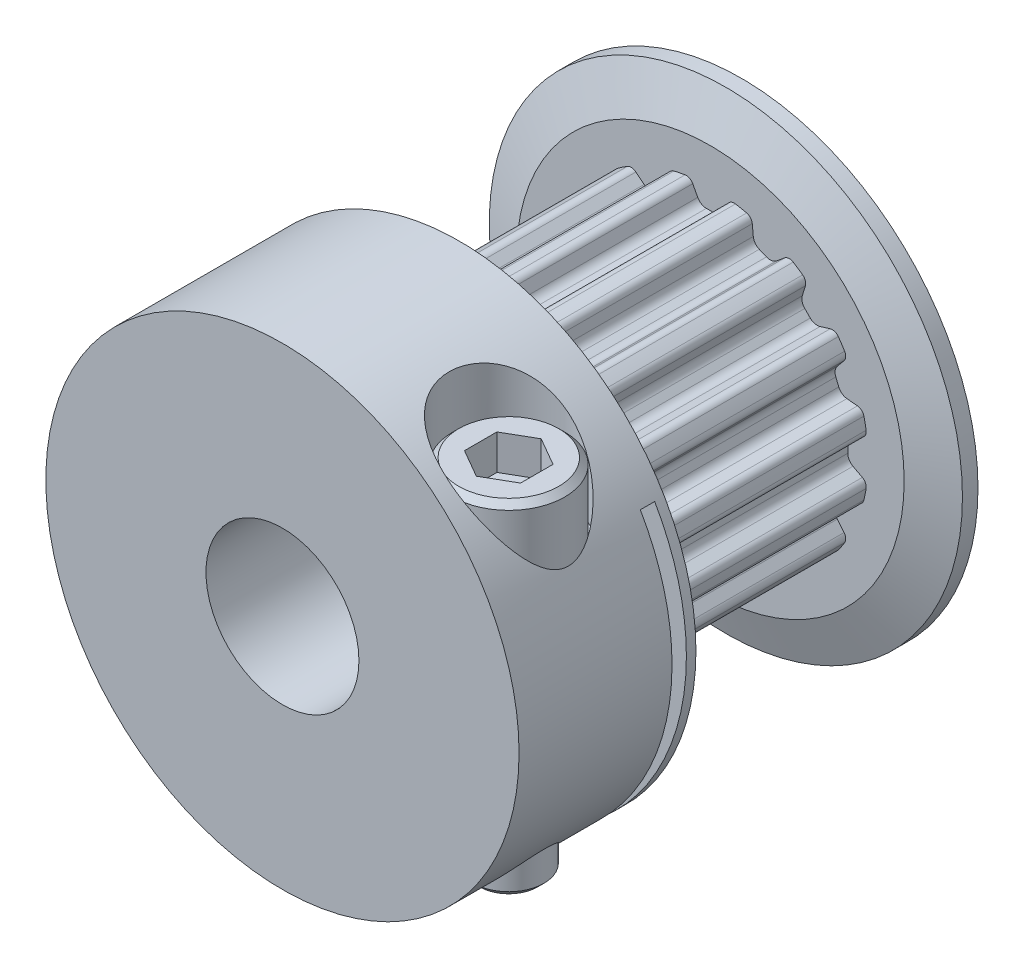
from build123d import *

# Parameters (mm, degrees)
SKETCH1_W               = 5.953125
SKETCH1_H               = 4.98475
SKETCH2_W               = 0.446484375
SKETCH2_H               = 4.98475
CUT_REVOLVE1_ANGLE      = 180
CUT_EXTRUDE1_DEPTH      = 1.0922
EXTRUDE1_START          = 7.366
SKETCH7_R               = 4.9149
SKETCH7_R_2             = 2.38125
EXTRUDE1_DEPTH          = 7.366
CUT_EXTRUDE2_START      = -8.6979125
CUT_EXTRUDE2_DEPTH      = 8.6979125
CIRPATTERN1_COUNT       = 16
EXTRUDE2_START          = 0.4841875
SKETCH11_R              = 4.9149
SKETCH11_R_2            = 2.38125
EXTRUDE2_DEPTH          = 0.4841875
SKETCH12_R              = 3.673475
SKETCH12_R_2            = 3.622675
CUT_EXTRUDE_THIN1_DEPTH = 0.0508


with BuildPart() as part:
    # Sketch1 → Revolve1 (revolve)
    with BuildSketch(Plane(origin=(0, 0, 0), x_dir=(0, 0, -1), z_dir=(1, 0, 0)), mode=Mode.PRIVATE) as revolve1_sk:
        with Locations((-2.9765625, 4.873625)):
            Rectangle(SKETCH1_W, SKETCH1_H)
    revolve(revolve1_sk.sketch.rotate(Axis((0, 0, 6.25078125), (0, 0, -1)), 90), axis=Axis((0, 0, 6.25078125), (0, 0, -1)))

    # Sketch2 → Cut-Revolve1 (revolve, cut)
    with BuildSketch(Plane(origin=(0, 0, 0), x_dir=(0, 0, -1), z_dir=(-0.49999999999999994, 0.8660254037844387, 0))):
        with Locations((-0.967382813, 4.873625)):
            Rectangle(SKETCH2_W, SKETCH2_H)
    revolve(axis=Axis((0, 0, 1.212949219), (0, 0, 1)), revolution_arc=CUT_REVOLVE1_ANGLE, mode=Mode.SUBTRACT)

    # Sketch4 → Cut-Revolve2 (revolve, cut)
    with BuildSketch(Plane.XY.offset(3.571875), mode=Mode.PRIVATE) as cut_revolve2_sk:
        Polygon((2.807335, 6.810053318), (2.807335, 3.24104), (3.560953, 3.24104), (3.560953, -6.448067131), (4.664075, -6.448067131), (4.664075, 6.810053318), align=None)
    revolve(cut_revolve2_sk.sketch.rotate(Axis((4.664075, -7.110973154, 3.571875), (0, 1, 0)), 90), axis=Axis((4.664075, -7.110973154, 3.571875), (0, 1, 0)), mode=Mode.SUBTRACT)

    # Sketch5 → Revolve2 (revolve)
    with BuildSketch(Plane(origin=(4.664075, 0, 3.571875), x_dir=(1, 0, 0), z_dir=(0, 0, 1)), mode=Mode.PRIVATE) as revolve2_sk:
        Polygon((1.74752, 5.23494), (1.74752, 3.24104), (1.0922, 3.24104), (1.0922, -5.510759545), (0.9017, -5.701259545), (0, -5.701259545), (0, 5.42544), (1.55702, 5.42544), align=None)
    revolve(revolve2_sk.sketch.rotate(Axis((4.664075, -6.257594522, 3.571875), (0, 1, 0)), 90), axis=Axis((4.664075, -6.257594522, 3.571875), (0, 1, 0)))

    # Sketch6 → Cut-Extrude1 (cut)
    with BuildSketch(Plane(origin=(0, 5.42544, 0), x_dir=(-1, 0, 0), z_dir=(0, 1, 0))):
        Polygon((-4.664075, 2.562943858), (-3.790315, 3.067409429), (-3.790315, 4.076340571), (-4.664075, 4.580806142), (-5.537835, 4.076340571), (-5.537835, 3.067409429), align=None)
    extrude(amount=-CUT_EXTRUDE1_DEPTH, mode=Mode.SUBTRACT)

    # Sketch7 → Extrude1 (add)
    with BuildSketch(Plane(origin=(0, 0, 0), x_dir=(-1, 0, 0), z_dir=(0, 0, -1)).offset(EXTRUDE1_START)):
        with Locations(Location((0, 0, 0), (0, 0, 180))):
            Circle(SKETCH7_R)
        with Locations(Location((0, 0, 0), (0, 0, 180))):
            Circle(SKETCH7_R_2, mode=Mode.SUBTRACT)
    extrude(amount=-EXTRUDE1_DEPTH)

    # Sketch8 → Cut-Extrude2 (cut)
    with BuildSketch(Plane(origin=(0, 0, 0), x_dir=(0.9238795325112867, -0.3826834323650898, 0), z_dir=(0, 0, 1)).offset(CUT_EXTRUDE2_START)):
        with BuildLine():
            Line((0.121657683, 4.2799), (-0.121657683, 4.2799))
            ThreePointArc((-0.121657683, 4.2799), (-0.278641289, 4.323435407), (-0.39078011, 4.441605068))
            Line((-0.39078011, 4.441605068), (-0.546016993, 4.733563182))
            ThreePointArc((-0.546016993, 4.733563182), (-0.646184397, 4.830986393), (-0.78433973, 4.851912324))
            ThreePointArc((-0.78433973, 4.851912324), (0, 4.9149), (0.78433973, 4.851912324))
            ThreePointArc((0.78433973, 4.851912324), (0.646184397, 4.830986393), (0.546016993, 4.733563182))
            Line((0.546016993, 4.733563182), (0.39078011, 4.441605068))
            ThreePointArc((0.39078011, 4.441605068), (0.278641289, 4.323435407), (0.121657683, 4.2799))
        make_face()
    cut_extrude2 = extrude(amount=CUT_EXTRUDE2_DEPTH, mode=Mode.SUBTRACT)

    # CirPattern1: Cut-Extrude2 ×16 about axis
    cirpattern1_axis = Axis((0, 0, 0), (0, 0, 1))
    for i in range(1, CIRPATTERN1_COUNT):
        add(cut_extrude2.rotate(cirpattern1_axis, i * 360 / CIRPATTERN1_COUNT), mode=Mode.SUBTRACT)

    # Sketch9 → Revolve3 (revolve)
    with BuildSketch(Plane(origin=(0, 0, 0), x_dir=(0, 0, -1), z_dir=(1, 0, 0)), mode=Mode.PRIVATE) as revolve3_sk:
        Polygon((7.366, 2.38125), (7.366, 6.035705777), (7.8501875, 7.366), (8.334375, 7.366), (7.8501875, 6.035705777), (7.8501875, 2.38125), align=None)
    revolve(revolve3_sk.sketch.rotate(Axis((0, 0, 0.41671875), (0, 0, -1)), 90), axis=Axis((0, 0, 0.41671875), (0, 0, -1)))

    # Sketch10 → Cut-Revolve3 (revolve, cut)
    with BuildSketch(Plane(origin=(0, 0, 0), x_dir=(0, 0, -1), z_dir=(1, 0, 0)), mode=Mode.PRIVATE) as cut_revolve3_sk:
        Polygon((0, 6.035705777), (-0.446484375, 7.366), (0, 7.366), align=None)
    revolve(cut_revolve3_sk.sketch.rotate(Axis((0, 0, 0.837108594), (0, 0, -1)), 90), axis=Axis((0, 0, 0.837108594), (0, 0, -1)), mode=Mode.SUBTRACT)

    # Sketch11 → Extrude2 (add)
    with BuildSketch(Plane(origin=(0, 0, -7.8501875), x_dir=(-1, 0, 0), z_dir=(0, 0, -1)).offset(EXTRUDE2_START)):
        with Locations(Location((0, 0, 0), (0, 0, 180))):
            Circle(SKETCH11_R)
        with Locations(Location((0, 0, 0), (0, 0, 180))):
            Circle(SKETCH11_R_2, mode=Mode.SUBTRACT)
    extrude(amount=-EXTRUDE2_DEPTH)

    # Sketch12 → Cut-Extrude-Thin1 (cut)
    with BuildSketch(Plane(origin=(0, 0, -8.334375), x_dir=(-1, 0, 0), z_dir=(0, 0, -1))):
        Circle(SKETCH12_R)
        Circle(SKETCH12_R_2, mode=Mode.SUBTRACT)
    extrude(amount=-CUT_EXTRUDE_THIN1_DEPTH, mode=Mode.SUBTRACT)


solid = part.part
